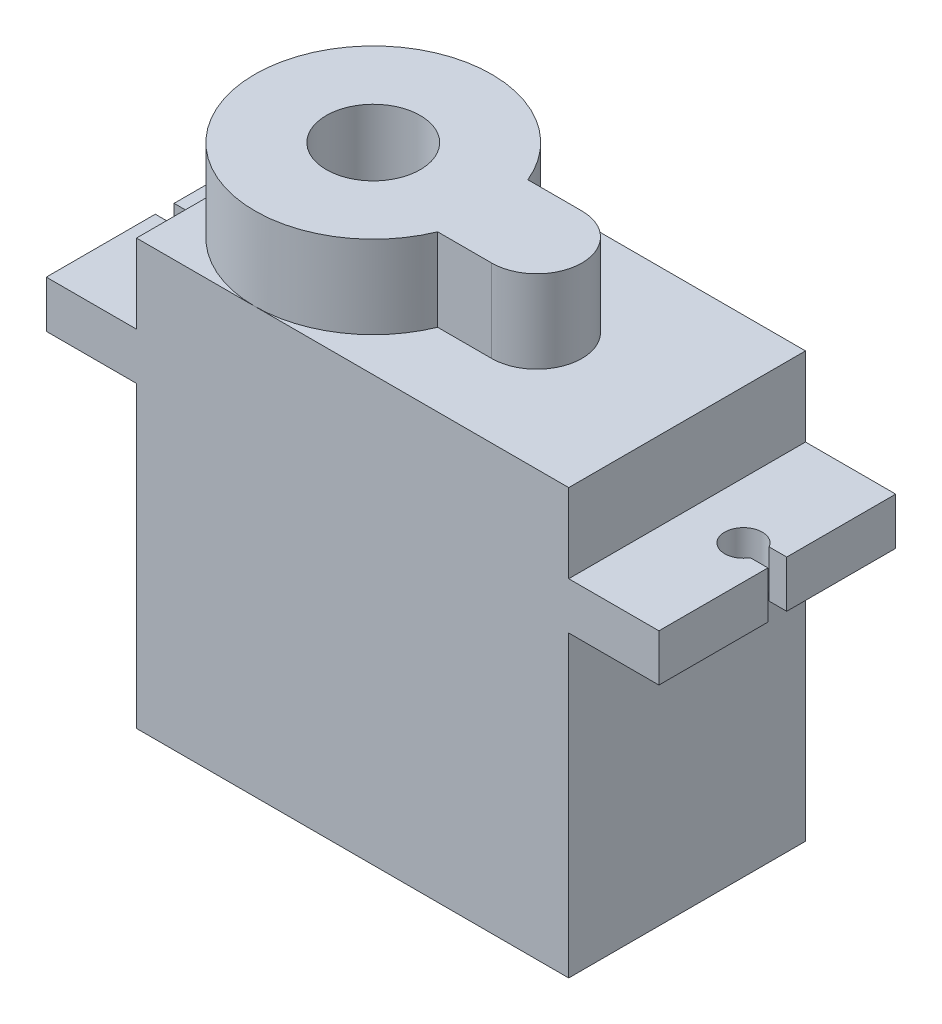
from build123d import *

# Parameters (mm, degrees)
SALIENTE_EXTRUIR1_DEPTH = 12.6
CROQUIS2_R              = 1
CROQUIS2_W              = 0.933974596
CROQUIS2_H              = 1
CORTAR_EXTRUIR2_DEPTH   = 2.5
CROQUIS4_R              = 2.5
SALIENTE_EXTRUIR4_DEPTH = 4.4


with BuildPart() as part:
    # Croquis1 → Saliente-Extruir1 (new body)
    with BuildSketch(Plane.XY):
        Polygon((11.5, 0), (-11.5, 0), (-11.5, 15.9), (-16.3, 15.9), (-16.3, 18.4), (-11.5, 18.4), (-11.5, 22.6), (11.5, 22.6), (11.5, 18.4), (16.3, 18.4), (16.3, 15.9), (11.5, 15.9), align=None)
    extrude(amount=SALIENTE_EXTRUIR1_DEPTH)

    # Croquis2 → Cortar-Extruir2 (cut)
    with BuildSketch(Plane(origin=(0, 18.4, 0), x_dir=(1, 0, 0), z_dir=(0, 1, 0))):
        with Locations((-14.5, -6.3)):
            Circle(CROQUIS2_R)
        with Locations((14.5, -6.3)):
            Circle(CROQUIS2_R)
        with Locations((-15.833012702, -6.3)):
            Rectangle(CROQUIS2_W, CROQUIS2_H)
        with Locations((15.833012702, -6.3)):
            Rectangle(CROQUIS2_W, CROQUIS2_H)
    extrude(amount=-CORTAR_EXTRUIR2_DEPTH, mode=Mode.SUBTRACT)

    # Croquis4 → Saliente-Extruir4 (add)
    # profile 1 of 8: a face of its own
    with BuildSketch(Plane(origin=(0, 22.6, 0), x_dir=(1, 0, 0), z_dir=(0, 1, 0))):
        with BuildLine():
            Line((0.624946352, -8.7), (-1.3, -8.7))
            Line((-1.3, -8.7), (-1.3, -3.9))
            Line((-1.3, -3.9), (0.624946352, -3.9))
            ThreePointArc((0.624946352, -3.9), (-11.5, -6.3), (0.624946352, -8.7))
        make_face()
        with Locations(Location((-5.2, -6.3, 0), (0, 0, 270))):
            Circle(CROQUIS4_R, mode=Mode.SUBTRACT)
    # profile 2 of 8: a face of its own
    with BuildSketch(Plane(origin=(0, 22.6, 0), x_dir=(1, 0, 0), z_dir=(0, 1, 0))):
        with BuildLine():
            ThreePointArc((1.1, -6.3), (1.802943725, -7.997056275), (3.5, -8.7))
            Line((3.5, -8.7), (3.5, -3.9))
            ThreePointArc((3.5, -3.9), (1.802943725, -4.602943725), (1.1, -6.3))
        make_face()
    # profile 3 of 8: a face of its own
    with BuildSketch(Plane(origin=(0, 22.6, 0), x_dir=(1, 0, 0), z_dir=(0, 1, 0))):
        with BuildLine():
            Line((3.5, -3.9), (3.5, -8.7))
            ThreePointArc((3.5, -8.7), (5.197056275, -7.997056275), (5.9, -6.3))
            ThreePointArc((5.9, -6.3), (5.197056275, -4.602943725), (3.5, -3.9))
        make_face()
    # profile 4 of 8: a face of its own
    with BuildSketch(Plane(origin=(0, 22.6, 0), x_dir=(1, 0, 0), z_dir=(0, 1, 0))):
        with BuildLine():
            ThreePointArc((1.1, -6.3), (1.802943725, -7.997056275), (3.5, -8.7))
            Line((3.5, -8.7), (3.5, -3.9))
            ThreePointArc((3.5, -3.9), (1.802943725, -4.602943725), (1.1, -6.3))
        make_face()
    # profile 5 of 8: a face of its own
    with BuildSketch(Plane(origin=(0, 22.6, 0), x_dir=(1, 0, 0), z_dir=(0, 1, 0))):
        with BuildLine():
            Line((3.5, -3.9), (3.5, -8.7))
            ThreePointArc((3.5, -8.7), (5.197056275, -7.997056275), (5.9, -6.3))
            ThreePointArc((5.9, -6.3), (5.197056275, -4.602943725), (3.5, -3.9))
        make_face()
    # profile 6 of 8: a face of its own
    with BuildSketch(Plane(origin=(0, 22.6, 0), x_dir=(1, 0, 0), z_dir=(0, 1, 0))):
        with BuildLine():
            ThreePointArc((1.1, -6.3), (0.98009555, -7.523282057), (0.624946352, -8.7))
            Line((0.624946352, -8.7), (3.5, -8.7))
            ThreePointArc((3.5, -8.7), (1.802943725, -7.997056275), (1.1, -6.3))
        make_face()
    # profile 7 of 8: a face of its own
    with BuildSketch(Plane(origin=(0, 22.6, 0), x_dir=(1, 0, 0), z_dir=(0, 1, 0))):
        with BuildLine():
            Line((3.5, -3.9), (0.624946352, -3.9))
            ThreePointArc((0.624946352, -3.9), (0.98009555, -5.076717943), (1.1, -6.3))
            ThreePointArc((1.1, -6.3), (1.802943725, -4.602943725), (3.5, -3.9))
        make_face()
    # profile 8 of 8: a face of its own
    with BuildSketch(Plane(origin=(0, 22.6, 0), x_dir=(1, 0, 0), z_dir=(0, 1, 0))):
        with BuildLine():
            Line((-1.3, -3.9), (-1.3, -8.7))
            Line((-1.3, -8.7), (0.624946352, -8.7))
            ThreePointArc((0.624946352, -8.7), (0.98009555, -7.523282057), (1.1, -6.3))
            ThreePointArc((1.1, -6.3), (0.98009555, -5.076717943), (0.624946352, -3.9))
            Line((0.624946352, -3.9), (-1.3, -3.9))
        make_face()
    extrude(amount=SALIENTE_EXTRUIR4_DEPTH)


solid = part.part
